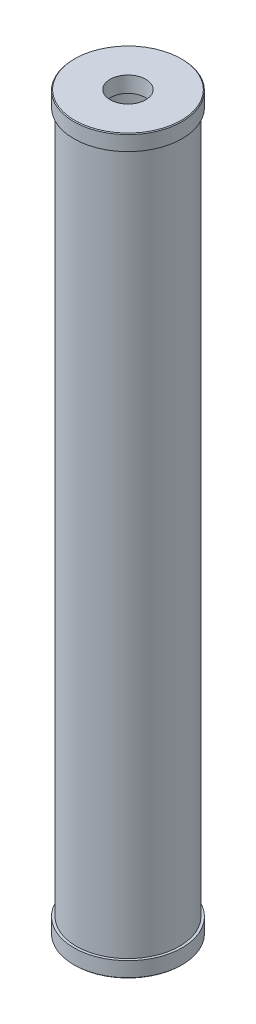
from build123d import *

# Parameters (mm, degrees)
SKETCH1_R           = 84.201
SKETCH1_R_2         = 74.676
BOSS_EXTRUDE1_DEPTH = 1193.8
SKETCH2_R           = 88.265
BOSS_EXTRUDE2_DEPTH = 25.4
BOSS_EXTRUDE3_START = -25.4
SKETCH3_R           = 88.265
BOSS_EXTRUDE3_DEPTH = 25.4
CHAMFER1_SIZE       = 1.27


with BuildPart() as part:
    # Sketch1 → Boss-Extrude1 (new body)
    with BuildSketch(Plane(origin=(0, 0, 0), x_dir=(1, 0, 0), z_dir=(0, 1, 0))):
        with Locations(Location((0, 0, 0), (0, 0, 270))):
            Circle(SKETCH1_R)
        with Locations(Location((0, 0, 0), (0, 0, 270))):
            Circle(SKETCH1_R_2, mode=Mode.SUBTRACT)
    extrude(amount=BOSS_EXTRUDE1_DEPTH)

    # Sketch2 → Boss-Extrude2 (add)
    with BuildSketch(Plane(origin=(0, 0, 0), x_dir=(1, 0, 0), z_dir=(0, 1, 0))):
        with Locations(Location((0, 0, 0), (0, 0, 270))):
            Circle(SKETCH2_R)
    extrude(amount=BOSS_EXTRUDE2_DEPTH)

    # Sketch3 → Boss-Extrude3 (add)
    with BuildSketch(Plane(origin=(0, 1193.8, 0), x_dir=(1, 0, 0), z_dir=(0, 1, 0)).offset(BOSS_EXTRUDE3_START)):
        with Locations(Location((0, 0, 0), (0, 0, 270))):
            Circle(SKETCH3_R)
    extrude(amount=BOSS_EXTRUDE3_DEPTH)

    # Sketch4 → 2 Rc Tapped Hole1 (revolve, cut)
    with BuildSketch(Plane(origin=(0, 1193.8, 0), x_dir=(0, 0, 1), z_dir=(1, 0, 0))):
        Polygon((0, 0), (0, 53.547580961), (27.4, 37.084), (27.4, 25.654), (28.265232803, 25.654), (29.066064, 0), align=None)
    revolve(axis=Axis((0, 1200.15, 0), (0, -1, 0)), mode=Mode.SUBTRACT)

    # Sketch10 → 2 Rc Tapped Hole2 (revolve, cut)
    with BuildSketch(Plane(origin=(0, 0, 0), x_dir=(0, 0, -1), z_dir=(1, 0, 0))):
        Polygon((0, 0), (0, 53.547580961), (27.4, 37.084), (27.4, 25.654), (28.265232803, 25.654), (29.066064, 0), align=None)
    revolve(axis=Axis((0, -6.35, 0), (0, 1, 0)), mode=Mode.SUBTRACT)

    # Chamfer1
    chamfer1_edges = [part.edges().sort_by_distance(p)[0] for p in [
        (0, 0, -88.265),
        (0, 1193.8, -88.265),
    ]]
    chamfer(chamfer1_edges, length=CHAMFER1_SIZE)


solid = part.part
